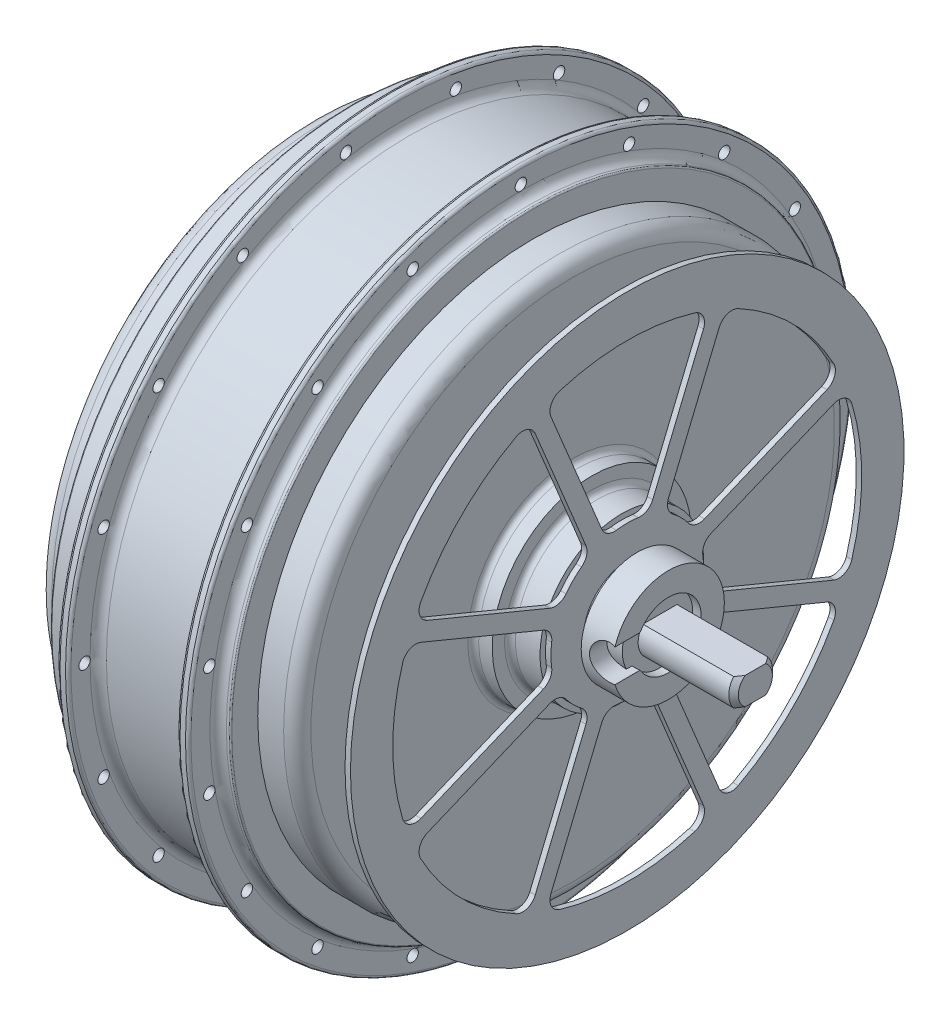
from build123d import *

# Parameters (mm, degrees)
FILLET1_R          = 5
FILLET2_R          = 3
FILLET3_R          = 1
FILLET4_R          = 0.5
FILLET5_R          = 2
CUT_EXTRUDE1_DEPTH = 10
CIRPATTERN1_COUNT  = 8
CUT_EXTRUDE2_DEPTH = 10
CIRPATTERN2_COUNT  = 16
SKETCH9_R          = 6.35
CUT_EXTRUDE3_DEPTH = 30
SKETCH12_R         = 2.1
CUT_EXTRUDE4_DEPTH = 30
CIRPATTERN3_COUNT  = 18
SKETCH13_R         = 2.1
CUT_EXTRUDE5_DEPTH = 30
CIRPATTERN4_COUNT  = 18
SKETCH14_W         = 50
SKETCH14_H         = 15
CUT_EXTRUDE6_DEPTH = 15
CHAMFER1_SIZE      = 1.75


with BuildPart() as part:
    # Sketch2 → Revolve1 (revolve)
    with BuildSketch(Plane.XY):
        Polygon((-71.5, 17.45), (-71.5, 0), (0, 0), (61, 0), (61, 30), (50, 30), (50, 36.5), (43, 36.5), (43, 101), (28.5, 101), (28.5, 111), (24, 111), (24, 122), (20, 122), (20, 111), (-20, 111), (-20, 122), (-24, 122), (-24, 111), (-37.5, 111), (-37.5, 101), (-52, 101), (-52, 26.5), (-57.5, 26.5), (-57.5, 17.45), align=None)
    revolve(axis=Axis((0, 0, 0), (-1, 0, 0)))

    # Fillet1
    fillet1_edges = [part.edges().sort_by_distance(p)[0] for p in [
        (-52, -101, 0),
        (43, -101, 0),
    ]]
    fillet(fillet1_edges, radius=FILLET1_R)

    # Fillet2
    fillet2_edges = [part.edges().sort_by_distance(p)[0] for p in [
        (-24, -111, 0),
        (-20, -111, 0),
        (20, -111, 0),
        (24, -111, 0),
    ]]
    fillet(fillet2_edges, radius=FILLET2_R)

    # Fillet3
    fillet3_edges = [part.edges().sort_by_distance(p)[0] for p in [
        (-24, -122, 0),
        (-20, -122, 0),
        (20, -122, 0),
        (24, -122, 0),
    ]]
    fillet(fillet3_edges, radius=FILLET3_R)

    # Fillet4
    fillet4_edges = [part.edges().sort_by_distance(p)[0] for p in [
        (-37.5, -111, 0),
        (28.5, -111, 0),
    ]]
    fillet(fillet4_edges, radius=FILLET4_R)

    # Fillet5
    fillet5_edges = [part.edges().sort_by_distance(p)[0] for p in [
        (-52, -26.5, 0),
        (43, -36.5, 0),
        (50, -30, 0),
    ]]
    fillet(fillet5_edges, radius=FILLET5_R)

    # Sketch12 → Cut-Extrude4 (cut)
    with BuildSketch(Plane(origin=(0, 0, 0), x_dir=(0, 0, -1), z_dir=(1, 0, 0))):
        with Locations(Location((0, 116, 0), (0, 0, 252.40603207))):
            Circle(SKETCH12_R)
    cut_extrude4 = extrude(amount=CUT_EXTRUDE4_DEPTH, mode=Mode.SUBTRACT)

    # CirPattern3: Cut-Extrude4 ×18 about axis
    cirpattern3_axis = Axis((0, 0, 0), (1, 0, 0))
    for i in range(1, CIRPATTERN3_COUNT):
        add(cut_extrude4.rotate(cirpattern3_axis, i * 360 / CIRPATTERN3_COUNT), mode=Mode.SUBTRACT)

    # Sketch13 → Cut-Extrude5 (cut)
    with BuildSketch(Plane(origin=(0, 0, 0), x_dir=(0, 0, -1), z_dir=(1, 0, 0))):
        with Locations(Location((20.143188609, 114.237699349, 0), (0, 0, 277.593967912))):
            Circle(SKETCH13_R)
    cut_extrude5 = extrude(amount=-CUT_EXTRUDE5_DEPTH, mode=Mode.SUBTRACT)

    # CirPattern4: Cut-Extrude5 ×18 about axis
    cirpattern4_axis = Axis((0, 0, 0), (1, 0, 0))
    for i in range(1, CIRPATTERN4_COUNT):
        add(cut_extrude5.rotate(cirpattern4_axis, i * 360 / CIRPATTERN4_COUNT), mode=Mode.SUBTRACT)


with BuildPart() as body_2:
    # Sketch3 → Revolve2 (revolve)
    with BuildSketch(Plane.XY, mode=Mode.PRIVATE) as revolve2_sk:
        Polygon((0, 0), (-110, 0), (-110, 8), (-75, 8), (-75, 10), (-71.5, 10), (61, 10), (61, 14.46022324), (75, 13.8), (75, 8), (110, 8), (110, 0), align=None)
    revolve(revolve2_sk.sketch.rotate(Axis((0, 0, 0), (1, 0, 0)), 180), axis=Axis((0, 0, 0), (1, 0, 0)))

    # Sketch14 → Cut-Extrude6 (cut, symmetric)
    with BuildSketch(Plane.XY):
        with Locations((-100, 12.5)):
            Rectangle(SKETCH14_W, SKETCH14_H)
        with Locations((-100, -12.5)):
            Rectangle(SKETCH14_W, SKETCH14_H)
        with Locations((100, 12.5)):
            Rectangle(SKETCH14_W, SKETCH14_H)
        with Locations((100, -12.5)):
            Rectangle(SKETCH14_W, SKETCH14_H)
    extrude(amount=CUT_EXTRUDE6_DEPTH, both=True, mode=Mode.SUBTRACT)

    # Chamfer1
    chamfer1_edges = [body_2.edges().sort_by_distance(p)[0] for p in [
        (-110, 0, -8),
        (-110, 0, 8),
        (110, 0, -8),
        (110, 0, 8),
    ]]
    chamfer(chamfer1_edges, length=CHAMFER1_SIZE)


with BuildPart() as body_3:
    # Sketch4 → Revolve3 (revolve)
    with BuildSketch(Plane.XY, mode=Mode.PRIVATE) as revolve3_sk:
        Polygon((63, 101.5), (63, 16), (61, 16), (61, 30), (61, 101.5), align=None)
    revolve(revolve3_sk.sketch.rotate(Axis((61, 0, 0), (1, 0, 0)), 180), axis=Axis((61, 0, 0), (1, 0, 0)))

    # Sketch5 → Cut-Extrude1 (cut)
    with BuildSketch(Plane(origin=(63, 0, 0), x_dir=(0, 0, -1), z_dir=(1, 0, 0))):
        with BuildLine():
            Line((9.350584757, 30.745668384), (27.951927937, 75.653283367))
            ThreePointArc((27.951927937, 75.653283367), (27.849985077, 79.709736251), (24.772809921, 82.354768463))
            ThreePointArc((24.772809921, 82.354768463), (0, 86), (-24.772809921, 82.354768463))
            ThreePointArc((-24.772809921, 82.354768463), (-27.849985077, 79.709736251), (-27.951927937, 75.653283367))
            Line((-27.951927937, 75.653283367), (-9.350584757, 30.745668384))
            ThreePointArc((-9.350584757, 30.745668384), (-7.203063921, 28.312842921), (-4.014340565, 27.710739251))
            ThreePointArc((-4.014340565, 27.710739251), (0, 28), (4.014340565, 27.710739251))
            ThreePointArc((4.014340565, 27.710739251), (7.203063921, 28.312842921), (9.350584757, 30.745668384))
        make_face()
    cut_extrude1 = extrude(amount=-CUT_EXTRUDE1_DEPTH, mode=Mode.SUBTRACT)

    # CirPattern1: Cut-Extrude1 ×8 about axis
    cirpattern1_axis = Axis((0, 0, 0), (1, 0, 0))
    for i in range(1, CIRPATTERN1_COUNT):
        add(cut_extrude1.rotate(cirpattern1_axis, i * 360 / CIRPATTERN1_COUNT), mode=Mode.SUBTRACT)


with BuildPart() as body_4:
    # Sketch6 → Revolve4 (revolve)
    with BuildSketch(Plane.XY, mode=Mode.PRIVATE) as revolve4_sk:
        Polygon((-74, 17.45), (-71.5, 17.45), (-58, 17.45), (-58, 27.25), (-64.9, 27.25), (-64.9, 35.25), (-67.1, 35.25), (-67.1, 27.25), (-74, 27.25), align=None)
    revolve(revolve4_sk.sketch.rotate(Axis((0, 0, 0), (-1, 0, 0)), 270), axis=Axis((0, 0, 0), (-1, 0, 0)))

    # Sketch7 → Cut-Extrude2 (cut)
    with BuildSketch(Plane.ZY.offset(67.1)):
        with BuildLine():
            Line((-6.350852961, 36), (-3.031088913, 30.25))
            ThreePointArc((-3.031088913, 30.25), (0, 28.5), (3.031088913, 30.25))
            Line((3.031088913, 30.25), (6.350852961, 36))
            Line((6.350852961, 36), (-6.350852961, 36))
        make_face()
    cut_extrude2 = extrude(amount=-CUT_EXTRUDE2_DEPTH, mode=Mode.SUBTRACT)

    # CirPattern2: Cut-Extrude2 ×16 about axis
    cirpattern2_axis = Axis((0, 0, 0), (1, 0, 0))
    for i in range(1, CIRPATTERN2_COUNT):
        add(cut_extrude2.rotate(cirpattern2_axis, i * 360 / CIRPATTERN2_COUNT), mode=Mode.SUBTRACT)


with BuildPart() as body_5:
    # Sketch8 → Revolve5 (revolve)
    with BuildSketch(Plane.XY, mode=Mode.PRIVATE) as revolve5_sk:
        Polygon((75, 12), (78.12, 12), (78.12, 20.5), (66.62, 20.5), (66.62, 14.195190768), (75, 13.8), align=None)
    revolve(revolve5_sk.sketch.rotate(Axis((0, 0, 0), (1, 0, 0)), 90), axis=Axis((0, 0, 0), (1, 0, 0)))

    # Sketch9 → Cut-Extrude3 (cut)
    with BuildSketch(Plane.XY):
        with Locations((76, 0)):
            Circle(SKETCH9_R)
    extrude(amount=CUT_EXTRUDE3_DEPTH, mode=Mode.SUBTRACT)


with BuildPart() as body_6:
    # Sketch10 → Revolve6 (revolve)
    with BuildSketch(Plane.XY, mode=Mode.PRIVATE) as revolve6_sk:
        Polygon((-75, 10), (-75, 15), (-77.88, 15), (-77.88, 8), (-75, 8), align=None)
    revolve(revolve6_sk.sketch.rotate(Axis((0, 0, 0), (-1, 0, 0)), 270), axis=Axis((0, 0, 0), (-1, 0, 0)))


solid = Compound([part.part, body_2.part, body_3.part, body_4.part, body_5.part, body_6.part])
